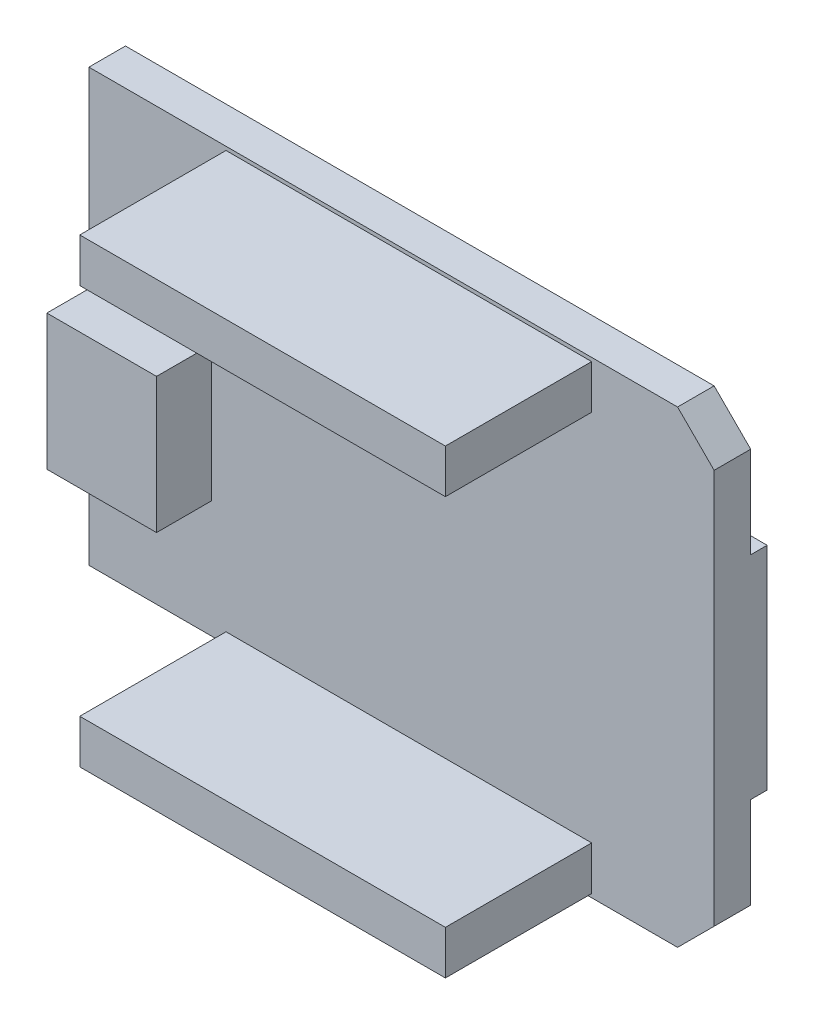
from build123d import *

# Parameters (mm, degrees)
BOSS_EXTRU_1_DEPTH = 2
ESQUISSE2_W        = 20
ESQUISSE2_H        = 2.4
BOSS_EXTRU_2_DEPTH = 8
ESQUISSE4_W        = 6
ESQUISSE4_H        = 7.4
BOSS_EXTRU_3_DEPTH = 3
ESQUISSE5_W        = 15
ESQUISSE5_H        = 11.6
BOSS_EXTRU_4_DEPTH = 3
ESQUISSE6_W        = 7
ESQUISSE6_H        = 11.597622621
BOSS_EXTRU_5_DEPTH = 0.9


with BuildPart() as part:
    # Esquisse1 → Boss.-Extru.1 (new body)
    with BuildSketch(Plane.XY):
        Polygon((17.181863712, 10.103315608), (19.181863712, 8.103315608), (19.181863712, -13.496684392), (17.181863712, -15.496684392), (-7.618136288, -15.496684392), (-7.618136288, -13.496684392), (-15.018136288, -13.496684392), (-15.018136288, -7.896684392), (-14.018136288, -7.896684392), (-14.018136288, 1.103315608), (-15.018136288, 1.103315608), (-15.018136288, 10.103315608), align=None)
    extrude(amount=BOSS_EXTRU_1_DEPTH)

    # Esquisse2 → Boss.-Extru.2 (add)
    with BuildSketch(Plane.XY.offset(2)):
        with Locations((2.481863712, 8.703315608)):
            Rectangle(ESQUISSE2_W, ESQUISSE2_H)
        with Locations((2.481863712, -14.096684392)):
            Rectangle(ESQUISSE2_W, ESQUISSE2_H)
    extrude(amount=BOSS_EXTRU_2_DEPTH)

    # Esquisse4 → Boss.-Extru.3 (add)
    with BuildSketch(Plane.XY.offset(2)):
        with Locations((-11.318136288, -3.396684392)):
            Rectangle(ESQUISSE4_W, ESQUISSE4_H)
    extrude(amount=BOSS_EXTRU_3_DEPTH)

    # Esquisse5 → Boss.-Extru.4 (add)
    with BuildSketch(Plane(origin=(0, 0, 0), x_dir=(-1, 0, 0), z_dir=(0, 0, -1))):
        with Locations((-4.681863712, -2.696684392)):
            Rectangle(ESQUISSE5_W, ESQUISSE5_H)
    extrude(amount=BOSS_EXTRU_4_DEPTH)

    # Esquisse6 → Boss.-Extru.5 (add)
    with BuildSketch(Plane(origin=(0, 0, 0), x_dir=(-1, 0, 0), z_dir=(0, 0, -1))):
        with Locations((-15.681863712, -2.695495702)):
            Rectangle(ESQUISSE6_W, ESQUISSE6_H)
    extrude(amount=BOSS_EXTRU_5_DEPTH)


solid = part.part
